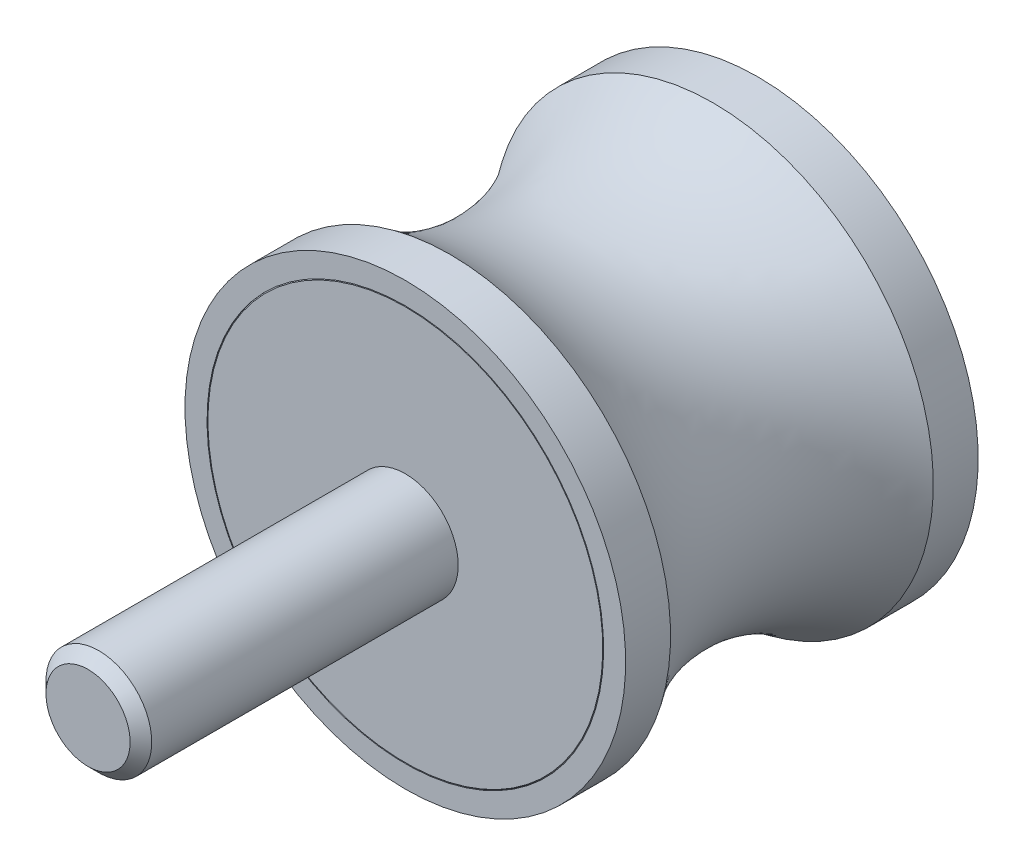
ISO-10303-21;
HEADER;
FILE_DESCRIPTION(('STEP AP214'),'2;1');
FILE_NAME('part.step','',(''),(''),'','','');
FILE_SCHEMA(('AUTOMOTIVE_DESIGN { 1 0 10303 214 1 1 1 1 }'));
ENDSEC;
DATA;
#1=APPLICATION_CONTEXT('core data for automotive mechanical design processes');
#2=APPLICATION_PROTOCOL_DEFINITION('international standard','automotive_design',2000,#1);
#3=PRODUCT_CONTEXT('',#1,'mechanical');
#4=PRODUCT('Part','Part','',(#3));
#5=PRODUCT_RELATED_PRODUCT_CATEGORY('part','',(#4));
#6=PRODUCT_DEFINITION_FORMATION('','',#4);
#7=PRODUCT_DEFINITION_CONTEXT('part definition',#1,'design');
#8=PRODUCT_DEFINITION('design','',#6,#7);
#9=PRODUCT_DEFINITION_SHAPE('','',#8);
#10=(LENGTH_UNIT() NAMED_UNIT(*) SI_UNIT(.MILLI.,.METRE.));
#11=(NAMED_UNIT(*) PLANE_ANGLE_UNIT() SI_UNIT($,.RADIAN.));
#12=(NAMED_UNIT(*) SI_UNIT($,.STERADIAN.) SOLID_ANGLE_UNIT());
#13=UNCERTAINTY_MEASURE_WITH_UNIT(LENGTH_MEASURE(1.E-05),#10,'distance_accuracy_value','');
#14=(GEOMETRIC_REPRESENTATION_CONTEXT(3) GLOBAL_UNCERTAINTY_ASSIGNED_CONTEXT((#13)) GLOBAL_UNIT_ASSIGNED_CONTEXT((#10,
#11,#12)) REPRESENTATION_CONTEXT('',''));
#15=CARTESIAN_POINT('',(0.,0.,0.));
#16=DIRECTION('',(0.,0.,1.));
#17=DIRECTION('',(1.,0.,0.));
#18=AXIS2_PLACEMENT_3D('',#15,#16,#17);
#19=CARTESIAN_POINT('',(0.,0.,0.5));
#20=DIRECTION('',(0.,0.,-1.));
#21=DIRECTION('',(0.,1.,0.));
#22=AXIS2_PLACEMENT_3D('',#19,#20,#21);
#23=CYLINDRICAL_SURFACE('',#22,11.25);
#24=CARTESIAN_POINT('',(0.,0.,0.05));
#25=DIRECTION('',(0.,0.,-1.));
#26=DIRECTION('',(0.,1.,0.));
#27=AXIS2_PLACEMENT_3D('',#24,#25,#26);
#28=CIRCLE('',#27,11.25);
#29=CARTESIAN_POINT('',(0.,11.25,0.05));
#30=VERTEX_POINT('',#29);
#31=EDGE_CURVE('E53',#30,#30,#28,.T.);
#32=ORIENTED_EDGE('',*,*,#31,.F.);
#33=EDGE_LOOP('',(#32));
#34=FACE_BOUND('',#33,.T.);
#35=CARTESIAN_POINT('',(0.,0.,0.));
#36=DIRECTION('',(0.,0.,-1.));
#37=DIRECTION('',(0.,1.,0.));
#38=AXIS2_PLACEMENT_3D('',#35,#36,#37);
#39=CIRCLE('',#38,11.25);
#40=CARTESIAN_POINT('',(0.,11.25,0.));
#41=VERTEX_POINT('',#40);
#42=EDGE_CURVE('E44',#41,#41,#39,.T.);
#43=ORIENTED_EDGE('',*,*,#42,.T.);
#44=EDGE_LOOP('',(#43));
#45=FACE_BOUND('',#44,.T.);
#46=ADVANCED_FACE('F12',(#34,#45),#23,.F.);
#47=CARTESIAN_POINT('',(0.,0.,0.5));
#48=DIRECTION('',(0.,0.,-1.));
#49=DIRECTION('',(0.,1.,0.));
#50=AXIS2_PLACEMENT_3D('',#47,#48,#49);
#51=CYLINDRICAL_SURFACE('',#50,11.25);
#52=CARTESIAN_POINT('',(0.,0.,20.));
#53=DIRECTION('',(0.,0.,-1.));
#54=DIRECTION('',(0.,1.,0.));
#55=AXIS2_PLACEMENT_3D('',#52,#53,#54);
#56=CIRCLE('',#55,11.25);
#57=CARTESIAN_POINT('',(0.,11.25,20.));
#58=VERTEX_POINT('',#57);
#59=EDGE_CURVE('E27',#58,#58,#56,.T.);
#60=ORIENTED_EDGE('',*,*,#59,.F.);
#61=EDGE_LOOP('',(#60));
#62=FACE_BOUND('',#61,.T.);
#63=CARTESIAN_POINT('',(0.,0.,19.95));
#64=DIRECTION('',(0.,0.,-1.));
#65=DIRECTION('',(0.,1.,0.));
#66=AXIS2_PLACEMENT_3D('',#63,#64,#65);
#67=CIRCLE('',#66,11.25);
#68=CARTESIAN_POINT('',(0.,11.25,19.95));
#69=VERTEX_POINT('',#68);
#70=EDGE_CURVE('E50',#69,#69,#67,.T.);
#71=ORIENTED_EDGE('',*,*,#70,.T.);
#72=EDGE_LOOP('',(#71));
#73=FACE_BOUND('',#72,.T.);
#74=ADVANCED_FACE('F89',(#62,#73),#51,.F.);
#75=CARTESIAN_POINT('',(11.25,0.,20.));
#76=DIRECTION('',(0.,0.,-1.));
#77=DIRECTION('',(0.,1.,0.));
#78=AXIS2_PLACEMENT_3D('',#75,#76,#77);
#79=PLANE('',#78);
#80=CARTESIAN_POINT('',(0.,0.,20.));
#81=DIRECTION('',(0.,0.,-1.));
#82=DIRECTION('',(0.,1.,0.));
#83=AXIS2_PLACEMENT_3D('',#80,#81,#82);
#84=CIRCLE('',#83,12.5);
#85=CARTESIAN_POINT('',(0.,12.5,20.));
#86=VERTEX_POINT('',#85);
#87=EDGE_CURVE('E32',#86,#86,#84,.T.);
#88=ORIENTED_EDGE('',*,*,#87,.F.);
#89=EDGE_LOOP('',(#88));
#90=FACE_BOUND('',#89,.T.);
#91=ORIENTED_EDGE('',*,*,#59,.T.);
#92=EDGE_LOOP('',(#91));
#93=FACE_BOUND('',#92,.T.);
#94=ADVANCED_FACE('F115',(#90,#93),#79,.F.);
#95=CARTESIAN_POINT('',(0.,0.,0.5));
#96=DIRECTION('',(0.,0.,-1.));
#97=DIRECTION('',(0.,1.,0.));
#98=AXIS2_PLACEMENT_3D('',#95,#96,#97);
#99=CYLINDRICAL_SURFACE('',#98,12.5);
#100=CARTESIAN_POINT('',(0.,0.,17.4535599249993));
#101=DIRECTION('',(0.,0.,-1.));
#102=DIRECTION('',(0.,1.,0.));
#103=AXIS2_PLACEMENT_3D('',#100,#101,#102);
#104=CIRCLE('',#103,12.5);
#105=CARTESIAN_POINT('',(0.,12.5,17.4535599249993));
#106=VERTEX_POINT('',#105);
#107=EDGE_CURVE('E35',#106,#106,#104,.T.);
#108=ORIENTED_EDGE('',*,*,#107,.F.);
#109=EDGE_LOOP('',(#108));
#110=FACE_BOUND('',#109,.T.);
#111=ORIENTED_EDGE('',*,*,#87,.T.);
#112=EDGE_LOOP('',(#111));
#113=FACE_BOUND('',#112,.T.);
#114=ADVANCED_FACE('F109',(#110,#113),#99,.T.);
#115=CARTESIAN_POINT('',(0.,0.,10.));
#116=DIRECTION('',(0.,0.,-1.));
#117=DIRECTION('',(0.,1.,0.));
#118=AXIS2_PLACEMENT_3D('',#115,#116,#117);
#119=TOROIDAL_SURFACE('',#118,22.3611111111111,12.3611111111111);
#120=CARTESIAN_POINT('',(0.,0.,2.5464400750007));
#121=DIRECTION('',(0.,0.,-1.));
#122=DIRECTION('',(0.,1.,0.));
#123=AXIS2_PLACEMENT_3D('',#120,#121,#122);
#124=CIRCLE('',#123,12.5);
#125=CARTESIAN_POINT('',(0.,12.5,2.5464400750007));
#126=VERTEX_POINT('',#125);
#127=EDGE_CURVE('E38',#126,#126,#124,.T.);
#128=ORIENTED_EDGE('',*,*,#127,.F.);
#129=EDGE_LOOP('',(#128));
#130=FACE_BOUND('',#129,.T.);
#131=ORIENTED_EDGE('',*,*,#107,.T.);
#132=EDGE_LOOP('',(#131));
#133=FACE_BOUND('',#132,.T.);
#134=ADVANCED_FACE('F103',(#130,#133),#119,.F.);
#135=CARTESIAN_POINT('',(0.,0.,0.5));
#136=DIRECTION('',(0.,0.,-1.));
#137=DIRECTION('',(0.,1.,0.));
#138=AXIS2_PLACEMENT_3D('',#135,#136,#137);
#139=CYLINDRICAL_SURFACE('',#138,12.5);
#140=CARTESIAN_POINT('',(0.,0.,0.));
#141=DIRECTION('',(0.,0.,-1.));
#142=DIRECTION('',(0.,1.,0.));
#143=AXIS2_PLACEMENT_3D('',#140,#141,#142);
#144=CIRCLE('',#143,12.5);
#145=CARTESIAN_POINT('',(0.,12.5,0.));
#146=VERTEX_POINT('',#145);
#147=EDGE_CURVE('E41',#146,#146,#144,.T.);
#148=ORIENTED_EDGE('',*,*,#147,.F.);
#149=EDGE_LOOP('',(#148));
#150=FACE_BOUND('',#149,.T.);
#151=ORIENTED_EDGE('',*,*,#127,.T.);
#152=EDGE_LOOP('',(#151));
#153=FACE_BOUND('',#152,.T.);
#154=ADVANCED_FACE('F97',(#150,#153),#139,.T.);
#155=CARTESIAN_POINT('',(12.5,0.,0.));
#156=DIRECTION('',(0.,0.,1.));
#157=DIRECTION('',(0.,-1.,0.));
#158=AXIS2_PLACEMENT_3D('',#155,#156,#157);
#159=PLANE('',#158);
#160=ORIENTED_EDGE('',*,*,#42,.F.);
#161=EDGE_LOOP('',(#160));
#162=FACE_BOUND('',#161,.T.);
#163=ORIENTED_EDGE('',*,*,#147,.T.);
#164=EDGE_LOOP('',(#163));
#165=FACE_BOUND('',#164,.T.);
#166=ADVANCED_FACE('F93',(#162,#165),#159,.F.);
#167=CARTESIAN_POINT('',(0.,0.,20.));
#168=DIRECTION('',(0.,0.,-1.));
#169=DIRECTION('',(0.,1.,0.));
#170=AXIS2_PLACEMENT_3D('',#167,#168,#169);
#171=PLANE('',#170);
#172=CARTESIAN_POINT('',(0.,0.,20.));
#173=DIRECTION('',(0.,0.,-1.));
#174=DIRECTION('',(0.,1.,0.));
#175=AXIS2_PLACEMENT_3D('',#172,#173,#174);
#176=CIRCLE('',#175,11.2);
#177=CARTESIAN_POINT('',(0.,11.2,20.));
#178=VERTEX_POINT('',#177);
#179=EDGE_CURVE('E47',#178,#178,#176,.T.);
#180=ORIENTED_EDGE('',*,*,#179,.F.);
#181=EDGE_LOOP('',(#180));
#182=FACE_BOUND('',#181,.T.);
#183=CARTESIAN_POINT('',(0.,0.,20.));
#184=DIRECTION('',(0.,0.,-1.));
#185=DIRECTION('',(0.,1.,0.));
#186=AXIS2_PLACEMENT_3D('',#183,#184,#185);
#187=CIRCLE('',#186,3.);
#188=CARTESIAN_POINT('',(0.,3.,20.));
#189=VERTEX_POINT('',#188);
#190=EDGE_CURVE('E8',#189,#189,#187,.T.);
#191=ORIENTED_EDGE('',*,*,#190,.T.);
#192=EDGE_LOOP('',(#191));
#193=FACE_BOUND('',#192,.T.);
#194=ADVANCED_FACE('F96',(#182,#193),#171,.F.);
#195=CARTESIAN_POINT('',(0.,0.,20.));
#196=DIRECTION('',(0.,0.,-1.));
#197=DIRECTION('',(0.,1.,0.));
#198=AXIS2_PLACEMENT_3D('',#195,#196,#197);
#199=CONICAL_SURFACE('',#198,11.2,0.785398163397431);
#200=ORIENTED_EDGE('',*,*,#70,.F.);
#201=EDGE_LOOP('',(#200));
#202=FACE_BOUND('',#201,.T.);
#203=ORIENTED_EDGE('',*,*,#179,.T.);
#204=EDGE_LOOP('',(#203));
#205=FACE_BOUND('',#204,.T.);
#206=ADVANCED_FACE('F129',(#202,#205),#199,.T.);
#207=CARTESIAN_POINT('',(0.,0.,38.));
#208=DIRECTION('',(0.,0.,-1.));
#209=DIRECTION('',(0.,1.,0.));
#210=AXIS2_PLACEMENT_3D('',#207,#208,#209);
#211=PLANE('',#210);
#212=CARTESIAN_POINT('',(0.,0.,38.));
#213=DIRECTION('',(0.,0.,-1.));
#214=DIRECTION('',(0.,1.,0.));
#215=AXIS2_PLACEMENT_3D('',#212,#213,#214);
#216=CIRCLE('',#215,2.3865);
#217=CARTESIAN_POINT('',(0.,2.3865,38.));
#218=VERTEX_POINT('',#217);
#219=EDGE_CURVE('E19',#218,#218,#216,.T.);
#220=ORIENTED_EDGE('',*,*,#219,.F.);
#221=EDGE_LOOP('',(#220));
#222=FACE_BOUND('',#221,.T.);
#223=ADVANCED_FACE('F14',(#222),#211,.F.);
#224=CARTESIAN_POINT('',(0.,0.,38.));
#225=DIRECTION('',(0.,0.,-1.));
#226=DIRECTION('',(0.,1.,0.));
#227=AXIS2_PLACEMENT_3D('',#224,#225,#226);
#228=CONICAL_SURFACE('',#227,2.3865,0.785398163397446);
#229=CARTESIAN_POINT('',(0.,0.,37.3865));
#230=DIRECTION('',(0.,0.,-1.));
#231=DIRECTION('',(0.,1.,0.));
#232=AXIS2_PLACEMENT_3D('',#229,#230,#231);
#233=CIRCLE('',#232,3.);
#234=CARTESIAN_POINT('',(0.,3.,37.3865));
#235=VERTEX_POINT('',#234);
#236=EDGE_CURVE('E23',#235,#235,#233,.T.);
#237=ORIENTED_EDGE('',*,*,#236,.F.);
#238=EDGE_LOOP('',(#237));
#239=FACE_BOUND('',#238,.T.);
#240=ORIENTED_EDGE('',*,*,#219,.T.);
#241=EDGE_LOOP('',(#240));
#242=FACE_BOUND('',#241,.T.);
#243=ADVANCED_FACE('F142',(#239,#242),#228,.T.);
#244=CARTESIAN_POINT('',(0.,0.,0.5));
#245=DIRECTION('',(0.,0.,-1.));
#246=DIRECTION('',(0.,1.,0.));
#247=AXIS2_PLACEMENT_3D('',#244,#245,#246);
#248=CYLINDRICAL_SURFACE('',#247,3.);
#249=ORIENTED_EDGE('',*,*,#190,.F.);
#250=EDGE_LOOP('',(#249));
#251=FACE_BOUND('',#250,.T.);
#252=ORIENTED_EDGE('',*,*,#236,.T.);
#253=EDGE_LOOP('',(#252));
#254=FACE_BOUND('',#253,.T.);
#255=ADVANCED_FACE('F83',(#251,#254),#248,.T.);
#256=CARTESIAN_POINT('',(0.,0.,0.05));
#257=DIRECTION('',(0.,0.,1.));
#258=DIRECTION('',(0.,-1.,0.));
#259=AXIS2_PLACEMENT_3D('',#256,#257,#258);
#260=CONICAL_SURFACE('',#259,11.25,0.785398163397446);
#261=CARTESIAN_POINT('',(0.,0.,0.));
#262=DIRECTION('',(0.,0.,-1.));
#263=DIRECTION('',(0.,1.,0.));
#264=AXIS2_PLACEMENT_3D('',#261,#262,#263);
#265=CIRCLE('',#264,11.2);
#266=CARTESIAN_POINT('',(0.,11.2,0.));
#267=VERTEX_POINT('',#266);
#268=EDGE_CURVE('E56',#267,#267,#265,.T.);
#269=ORIENTED_EDGE('',*,*,#268,.F.);
#270=EDGE_LOOP('',(#269));
#271=FACE_BOUND('',#270,.T.);
#272=ORIENTED_EDGE('',*,*,#31,.T.);
#273=EDGE_LOOP('',(#272));
#274=FACE_BOUND('',#273,.T.);
#275=ADVANCED_FACE('F77',(#271,#274),#260,.T.);
#276=CARTESIAN_POINT('',(11.2,0.,0.));
#277=DIRECTION('',(0.,0.,1.));
#278=DIRECTION('',(0.,-1.,0.));
#279=AXIS2_PLACEMENT_3D('',#276,#277,#278);
#280=PLANE('',#279);
#281=CARTESIAN_POINT('',(0.,0.,0.));
#282=DIRECTION('',(0.,0.,-1.));
#283=DIRECTION('',(0.,1.,0.));
#284=AXIS2_PLACEMENT_3D('',#281,#282,#283);
#285=CIRCLE('',#284,3.);
#286=CARTESIAN_POINT('',(0.,3.,0.));
#287=VERTEX_POINT('',#286);
#288=EDGE_CURVE('E60',#287,#287,#285,.T.);
#289=ORIENTED_EDGE('',*,*,#288,.F.);
#290=EDGE_LOOP('',(#289));
#291=FACE_BOUND('',#290,.T.);
#292=ORIENTED_EDGE('',*,*,#268,.T.);
#293=EDGE_LOOP('',(#292));
#294=FACE_BOUND('',#293,.T.);
#295=ADVANCED_FACE('F71',(#291,#294),#280,.F.);
#296=CARTESIAN_POINT('',(0.,0.,6.));
#297=DIRECTION('',(0.,0.,-1.));
#298=DIRECTION('',(0.,1.,0.));
#299=AXIS2_PLACEMENT_3D('',#296,#297,#298);
#300=CYLINDRICAL_SURFACE('',#299,3.);
#301=CARTESIAN_POINT('',(0.,0.,6.));
#302=DIRECTION('',(0.,0.,-1.));
#303=DIRECTION('',(0.,1.,0.));
#304=AXIS2_PLACEMENT_3D('',#301,#302,#303);
#305=CIRCLE('',#304,3.);
#306=CARTESIAN_POINT('',(0.,3.,6.));
#307=VERTEX_POINT('',#306);
#308=EDGE_CURVE('E59',#307,#307,#305,.T.);
#309=ORIENTED_EDGE('',*,*,#308,.F.);
#310=EDGE_LOOP('',(#309));
#311=FACE_BOUND('',#310,.T.);
#312=ORIENTED_EDGE('',*,*,#288,.T.);
#313=EDGE_LOOP('',(#312));
#314=FACE_BOUND('',#313,.T.);
#315=ADVANCED_FACE('F68',(#311,#314),#300,.F.);
#316=CARTESIAN_POINT('',(0.,0.,6.));
#317=DIRECTION('',(0.,0.,-1.));
#318=DIRECTION('',(0.,1.,0.));
#319=AXIS2_PLACEMENT_3D('',#316,#317,#318);
#320=PLANE('',#319);
#321=ORIENTED_EDGE('',*,*,#308,.T.);
#322=EDGE_LOOP('',(#321));
#323=FACE_BOUND('',#322,.T.);
#324=ADVANCED_FACE('F66',(#323),#320,.T.);
#325=CLOSED_SHELL('',(#46,#74,#94,#114,#134,#154,#166,#194,#206,#223,#243,#255,#275,#295,#315,#324));
#326=MANIFOLD_SOLID_BREP('B1',#325);
#327=ADVANCED_BREP_SHAPE_REPRESENTATION('',(#18,#326),#14);
#328=SHAPE_DEFINITION_REPRESENTATION(#9,#327);
ENDSEC;
END-ISO-10303-21;
